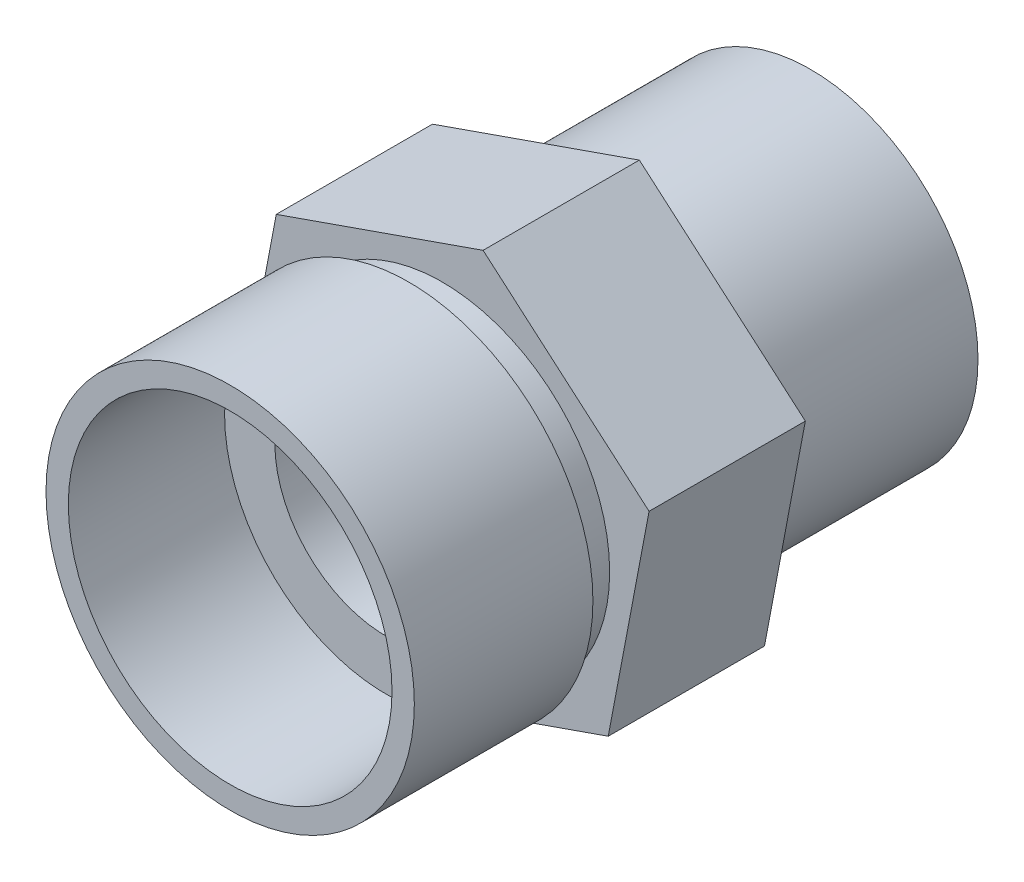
ISO-10303-21;
HEADER;
FILE_DESCRIPTION(('STEP AP214'),'2;1');
FILE_NAME('part.step','',(''),(''),'','','');
FILE_SCHEMA(('AUTOMOTIVE_DESIGN { 1 0 10303 214 1 1 1 1 }'));
ENDSEC;
DATA;
#1=APPLICATION_CONTEXT('core data for automotive mechanical design processes');
#2=APPLICATION_PROTOCOL_DEFINITION('international standard','automotive_design',2000,#1);
#3=PRODUCT_CONTEXT('',#1,'mechanical');
#4=PRODUCT('Part','Part','',(#3));
#5=PRODUCT_RELATED_PRODUCT_CATEGORY('part','',(#4));
#6=PRODUCT_DEFINITION_FORMATION('','',#4);
#7=PRODUCT_DEFINITION_CONTEXT('part definition',#1,'design');
#8=PRODUCT_DEFINITION('design','',#6,#7);
#9=PRODUCT_DEFINITION_SHAPE('','',#8);
#10=(LENGTH_UNIT() NAMED_UNIT(*) SI_UNIT(.MILLI.,.METRE.));
#11=(NAMED_UNIT(*) PLANE_ANGLE_UNIT() SI_UNIT($,.RADIAN.));
#12=(NAMED_UNIT(*) SI_UNIT($,.STERADIAN.) SOLID_ANGLE_UNIT());
#13=UNCERTAINTY_MEASURE_WITH_UNIT(LENGTH_MEASURE(1.E-05),#10,'distance_accuracy_value','');
#14=(GEOMETRIC_REPRESENTATION_CONTEXT(3) GLOBAL_UNCERTAINTY_ASSIGNED_CONTEXT((#13)) GLOBAL_UNIT_ASSIGNED_CONTEXT((#10,
#11,#12)) REPRESENTATION_CONTEXT('',''));
#15=CARTESIAN_POINT('',(0.,0.,0.));
#16=DIRECTION('',(0.,0.,1.));
#17=DIRECTION('',(1.,0.,0.));
#18=AXIS2_PLACEMENT_3D('',#15,#16,#17);
#19=CARTESIAN_POINT('',(7.43637258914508,-6.40575491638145,16.5));
#20=DIRECTION('',(0.,0.,1.));
#21=DIRECTION('',(1.,0.,0.));
#22=AXIS2_PLACEMENT_3D('',#19,#20,#21);
#23=PLANE('',#22);
#24=DIRECTION('',(0.944042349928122,0.329824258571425,0.));
#25=VECTOR('',#24,1.);
#26=CARTESIAN_POINT('',(-1.82936019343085,-9.64296503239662,16.5));
#27=LINE('',#26,#25);
#28=CARTESIAN_POINT('',(-1.82936019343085,-9.64296503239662,16.5));
#29=VERTEX_POINT('',#28);
#30=CARTESIAN_POINT('',(7.43637258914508,-6.40575491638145,16.5));
#31=VERTEX_POINT('',#30);
#32=EDGE_CURVE('E133',#29,#31,#27,.T.);
#33=ORIENTED_EDGE('',*,*,#32,.T.);
#34=DIRECTION('',(0.186384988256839,0.982476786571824,0.));
#35=VECTOR('',#34,1.);
#36=CARTESIAN_POINT('',(7.43637258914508,-6.40575491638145,16.5));
#37=LINE('',#36,#35);
#38=CARTESIAN_POINT('',(9.26573278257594,3.23721011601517,16.5));
#39=VERTEX_POINT('',#38);
#40=EDGE_CURVE('E91',#31,#39,#37,.T.);
#41=ORIENTED_EDGE('',*,*,#40,.T.);
#42=DIRECTION('',(-0.757657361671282,0.652652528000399,0.));
#43=VECTOR('',#42,1.);
#44=CARTESIAN_POINT('',(9.26573278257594,3.23721011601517,16.5));
#45=LINE('',#44,#43);
#46=CARTESIAN_POINT('',(1.82936019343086,9.64296503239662,16.5));
#47=VERTEX_POINT('',#46);
#48=EDGE_CURVE('E104',#39,#47,#45,.T.);
#49=ORIENTED_EDGE('',*,*,#48,.T.);
#50=DIRECTION('',(-0.944042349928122,-0.329824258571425,0.));
#51=VECTOR('',#50,1.);
#52=CARTESIAN_POINT('',(1.82936019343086,9.64296503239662,16.5));
#53=LINE('',#52,#51);
#54=CARTESIAN_POINT('',(-7.43637258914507,6.40575491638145,16.5));
#55=VERTEX_POINT('',#54);
#56=EDGE_CURVE('E98',#47,#55,#53,.T.);
#57=ORIENTED_EDGE('',*,*,#56,.T.);
#58=DIRECTION('',(-0.186384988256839,-0.982476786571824,0.));
#59=VECTOR('',#58,1.);
#60=CARTESIAN_POINT('',(-7.43637258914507,6.40575491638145,16.5));
#61=LINE('',#60,#59);
#62=CARTESIAN_POINT('',(-9.26573278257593,-3.23721011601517,16.5));
#63=VERTEX_POINT('',#62);
#64=EDGE_CURVE('E102',#55,#63,#61,.T.);
#65=ORIENTED_EDGE('',*,*,#64,.T.);
#66=DIRECTION('',(0.757657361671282,-0.652652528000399,0.));
#67=VECTOR('',#66,1.);
#68=CARTESIAN_POINT('',(-9.26573278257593,-3.23721011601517,16.5));
#69=LINE('',#68,#67);
#70=EDGE_CURVE('E53',#63,#29,#69,.T.);
#71=ORIENTED_EDGE('',*,*,#70,.T.);
#72=EDGE_LOOP('',(#33,#41,#49,#57,#65,#71));
#73=FACE_BOUND('',#72,.T.);
#74=CARTESIAN_POINT('',(0.,0.,16.5));
#75=DIRECTION('',(0.,0.,1.));
#76=DIRECTION('',(1.,0.,0.));
#77=AXIS2_PLACEMENT_3D('',#74,#75,#76);
#78=CIRCLE('',#77,7.5);
#79=CARTESIAN_POINT('',(7.5,0.,16.5));
#80=VERTEX_POINT('',#79);
#81=EDGE_CURVE('E195',#80,#80,#78,.T.);
#82=ORIENTED_EDGE('',*,*,#81,.F.);
#83=EDGE_LOOP('',(#82));
#84=FACE_BOUND('',#83,.T.);
#85=ADVANCED_FACE('F36',(#73,#84),#23,.T.);
#86=CARTESIAN_POINT('',(0.,0.,9.5));
#87=DIRECTION('',(0.,0.,-1.));
#88=DIRECTION('',(-1.,0.,0.));
#89=AXIS2_PLACEMENT_3D('',#86,#87,#88);
#90=CYLINDRICAL_SURFACE('',#89,7.5);
#91=CARTESIAN_POINT('',(0.,0.,9.5));
#92=DIRECTION('',(0.,0.,1.));
#93=DIRECTION('',(1.,0.,0.));
#94=AXIS2_PLACEMENT_3D('',#91,#92,#93);
#95=CIRCLE('',#94,7.5);
#96=CARTESIAN_POINT('',(7.5,0.,9.5));
#97=VERTEX_POINT('',#96);
#98=EDGE_CURVE('E45',#97,#97,#95,.T.);
#99=ORIENTED_EDGE('',*,*,#98,.F.);
#100=EDGE_LOOP('',(#99));
#101=FACE_BOUND('',#100,.T.);
#102=CARTESIAN_POINT('',(0.,0.,0.));
#103=DIRECTION('',(0.,0.,1.));
#104=DIRECTION('',(1.,0.,0.));
#105=AXIS2_PLACEMENT_3D('',#102,#103,#104);
#106=CIRCLE('',#105,7.5);
#107=CARTESIAN_POINT('',(7.5,0.,0.));
#108=VERTEX_POINT('',#107);
#109=EDGE_CURVE('E142',#108,#108,#106,.T.);
#110=ORIENTED_EDGE('',*,*,#109,.T.);
#111=EDGE_LOOP('',(#110));
#112=FACE_BOUND('',#111,.T.);
#113=ADVANCED_FACE('F38',(#101,#112),#90,.T.);
#114=CARTESIAN_POINT('',(0.,0.,0.));
#115=DIRECTION('',(0.,0.,1.));
#116=DIRECTION('',(1.,0.,0.));
#117=AXIS2_PLACEMENT_3D('',#114,#115,#116);
#118=PLANE('',#117);
#119=CARTESIAN_POINT('',(0.,0.,0.));
#120=DIRECTION('',(0.,0.,1.));
#121=DIRECTION('',(1.,0.,0.));
#122=AXIS2_PLACEMENT_3D('',#119,#120,#121);
#123=CIRCLE('',#122,5.);
#124=CARTESIAN_POINT('',(5.,0.,0.));
#125=VERTEX_POINT('',#124);
#126=EDGE_CURVE('E203',#125,#125,#123,.T.);
#127=ORIENTED_EDGE('',*,*,#126,.T.);
#128=EDGE_LOOP('',(#127));
#129=FACE_BOUND('',#128,.T.);
#130=ORIENTED_EDGE('',*,*,#109,.F.);
#131=EDGE_LOOP('',(#130));
#132=FACE_BOUND('',#131,.T.);
#133=ADVANCED_FACE('F148',(#129,#132),#118,.F.);
#134=CARTESIAN_POINT('',(7.43637258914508,-6.40575491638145,9.5));
#135=DIRECTION('',(0.,0.,1.));
#136=DIRECTION('',(1.,0.,0.));
#137=AXIS2_PLACEMENT_3D('',#134,#135,#136);
#138=PLANE('',#137);
#139=DIRECTION('',(0.944042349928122,0.329824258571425,0.));
#140=VECTOR('',#139,1.);
#141=CARTESIAN_POINT('',(-1.82936019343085,-9.64296503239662,9.5));
#142=LINE('',#141,#140);
#143=CARTESIAN_POINT('',(-1.82936019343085,-9.64296503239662,9.5));
#144=VERTEX_POINT('',#143);
#145=CARTESIAN_POINT('',(7.43637258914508,-6.40575491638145,9.5));
#146=VERTEX_POINT('',#145);
#147=EDGE_CURVE('E122',#144,#146,#142,.T.);
#148=ORIENTED_EDGE('',*,*,#147,.F.);
#149=DIRECTION('',(0.757657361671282,-0.652652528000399,0.));
#150=VECTOR('',#149,1.);
#151=CARTESIAN_POINT('',(-9.26573278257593,-3.23721011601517,9.5));
#152=LINE('',#151,#150);
#153=CARTESIAN_POINT('',(-9.26573278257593,-3.23721011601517,9.5));
#154=VERTEX_POINT('',#153);
#155=EDGE_CURVE('E82',#154,#144,#152,.T.);
#156=ORIENTED_EDGE('',*,*,#155,.F.);
#157=DIRECTION('',(-0.186384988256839,-0.982476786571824,0.));
#158=VECTOR('',#157,1.);
#159=CARTESIAN_POINT('',(-7.43637258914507,6.40575491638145,9.5));
#160=LINE('',#159,#158);
#161=CARTESIAN_POINT('',(-7.43637258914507,6.40575491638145,9.5));
#162=VERTEX_POINT('',#161);
#163=EDGE_CURVE('E76',#162,#154,#160,.T.);
#164=ORIENTED_EDGE('',*,*,#163,.F.);
#165=DIRECTION('',(-0.944042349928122,-0.329824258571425,0.));
#166=VECTOR('',#165,1.);
#167=CARTESIAN_POINT('',(1.82936019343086,9.64296503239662,9.5));
#168=LINE('',#167,#166);
#169=CARTESIAN_POINT('',(1.82936019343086,9.64296503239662,9.5));
#170=VERTEX_POINT('',#169);
#171=EDGE_CURVE('E112',#170,#162,#168,.T.);
#172=ORIENTED_EDGE('',*,*,#171,.F.);
#173=DIRECTION('',(-0.757657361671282,0.652652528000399,0.));
#174=VECTOR('',#173,1.);
#175=CARTESIAN_POINT('',(9.26573278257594,3.23721011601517,9.5));
#176=LINE('',#175,#174);
#177=CARTESIAN_POINT('',(9.26573278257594,3.23721011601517,9.5));
#178=VERTEX_POINT('',#177);
#179=EDGE_CURVE('E128',#178,#170,#176,.T.);
#180=ORIENTED_EDGE('',*,*,#179,.F.);
#181=DIRECTION('',(0.186384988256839,0.982476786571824,0.));
#182=VECTOR('',#181,1.);
#183=CARTESIAN_POINT('',(7.43637258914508,-6.40575491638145,9.5));
#184=LINE('',#183,#182);
#185=EDGE_CURVE('E125',#146,#178,#184,.T.);
#186=ORIENTED_EDGE('',*,*,#185,.F.);
#187=EDGE_LOOP('',(#148,#156,#164,#172,#180,#186));
#188=FACE_BOUND('',#187,.T.);
#189=ORIENTED_EDGE('',*,*,#98,.T.);
#190=EDGE_LOOP('',(#189));
#191=FACE_BOUND('',#190,.T.);
#192=ADVANCED_FACE('F150',(#188,#191),#138,.F.);
#193=CARTESIAN_POINT('',(-1.82936019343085,-9.64296503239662,16.5));
#194=DIRECTION('',(-0.329824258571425,0.944042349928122,0.));
#195=DIRECTION('',(-0.944042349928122,-0.329824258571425,0.));
#196=AXIS2_PLACEMENT_3D('',#193,#194,#195);
#197=PLANE('',#196);
#198=ORIENTED_EDGE('',*,*,#147,.T.);
#199=DIRECTION('',(0.,0.,-1.));
#200=VECTOR('',#199,1.);
#201=CARTESIAN_POINT('',(7.43637258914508,-6.40575491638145,16.5));
#202=LINE('',#201,#200);
#203=EDGE_CURVE('E140',#31,#146,#202,.T.);
#204=ORIENTED_EDGE('',*,*,#203,.F.);
#205=ORIENTED_EDGE('',*,*,#32,.F.);
#206=DIRECTION('',(0.,0.,-1.));
#207=VECTOR('',#206,1.);
#208=CARTESIAN_POINT('',(-1.82936019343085,-9.64296503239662,16.5));
#209=LINE('',#208,#207);
#210=EDGE_CURVE('E118',#29,#144,#209,.T.);
#211=ORIENTED_EDGE('',*,*,#210,.T.);
#212=EDGE_LOOP('',(#198,#204,#205,#211));
#213=FACE_BOUND('',#212,.T.);
#214=ADVANCED_FACE('F156',(#213),#197,.F.);
#215=CARTESIAN_POINT('',(7.43637258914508,-6.40575491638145,16.5));
#216=DIRECTION('',(-0.982476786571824,0.186384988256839,0.));
#217=DIRECTION('',(-0.186384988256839,-0.982476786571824,0.));
#218=AXIS2_PLACEMENT_3D('',#215,#216,#217);
#219=PLANE('',#218);
#220=ORIENTED_EDGE('',*,*,#185,.T.);
#221=DIRECTION('',(0.,0.,-1.));
#222=VECTOR('',#221,1.);
#223=CARTESIAN_POINT('',(9.26573278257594,3.23721011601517,16.5));
#224=LINE('',#223,#222);
#225=EDGE_CURVE('E137',#39,#178,#224,.T.);
#226=ORIENTED_EDGE('',*,*,#225,.F.);
#227=ORIENTED_EDGE('',*,*,#40,.F.);
#228=ORIENTED_EDGE('',*,*,#203,.T.);
#229=EDGE_LOOP('',(#220,#226,#227,#228));
#230=FACE_BOUND('',#229,.T.);
#231=ADVANCED_FACE('F180',(#230),#219,.F.);
#232=CARTESIAN_POINT('',(9.26573278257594,3.23721011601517,16.5));
#233=DIRECTION('',(-0.652652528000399,-0.757657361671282,0.));
#234=DIRECTION('',(0.757657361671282,-0.652652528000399,0.));
#235=AXIS2_PLACEMENT_3D('',#232,#233,#234);
#236=PLANE('',#235);
#237=ORIENTED_EDGE('',*,*,#179,.T.);
#238=DIRECTION('',(0.,0.,-1.));
#239=VECTOR('',#238,1.);
#240=CARTESIAN_POINT('',(1.82936019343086,9.64296503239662,16.5));
#241=LINE('',#240,#239);
#242=EDGE_CURVE('E113',#47,#170,#241,.T.);
#243=ORIENTED_EDGE('',*,*,#242,.F.);
#244=ORIENTED_EDGE('',*,*,#48,.F.);
#245=ORIENTED_EDGE('',*,*,#225,.T.);
#246=EDGE_LOOP('',(#237,#243,#244,#245));
#247=FACE_BOUND('',#246,.T.);
#248=ADVANCED_FACE('F177',(#247),#236,.F.);
#249=CARTESIAN_POINT('',(1.82936019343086,9.64296503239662,16.5));
#250=DIRECTION('',(0.329824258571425,-0.944042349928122,0.));
#251=DIRECTION('',(0.944042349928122,0.329824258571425,0.));
#252=AXIS2_PLACEMENT_3D('',#249,#250,#251);
#253=PLANE('',#252);
#254=ORIENTED_EDGE('',*,*,#171,.T.);
#255=DIRECTION('',(0.,0.,-1.));
#256=VECTOR('',#255,1.);
#257=CARTESIAN_POINT('',(-7.43637258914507,6.40575491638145,16.5));
#258=LINE('',#257,#256);
#259=EDGE_CURVE('E109',#55,#162,#258,.T.);
#260=ORIENTED_EDGE('',*,*,#259,.F.);
#261=ORIENTED_EDGE('',*,*,#56,.F.);
#262=ORIENTED_EDGE('',*,*,#242,.T.);
#263=EDGE_LOOP('',(#254,#260,#261,#262));
#264=FACE_BOUND('',#263,.T.);
#265=ADVANCED_FACE('F110',(#264),#253,.F.);
#266=CARTESIAN_POINT('',(-7.43637258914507,6.40575491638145,16.5));
#267=DIRECTION('',(0.982476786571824,-0.186384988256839,0.));
#268=DIRECTION('',(0.186384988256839,0.982476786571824,0.));
#269=AXIS2_PLACEMENT_3D('',#266,#267,#268);
#270=PLANE('',#269);
#271=ORIENTED_EDGE('',*,*,#163,.T.);
#272=DIRECTION('',(0.,0.,-1.));
#273=VECTOR('',#272,1.);
#274=CARTESIAN_POINT('',(-9.26573278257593,-3.23721011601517,16.5));
#275=LINE('',#274,#273);
#276=EDGE_CURVE('E114',#63,#154,#275,.T.);
#277=ORIENTED_EDGE('',*,*,#276,.F.);
#278=ORIENTED_EDGE('',*,*,#64,.F.);
#279=ORIENTED_EDGE('',*,*,#259,.T.);
#280=EDGE_LOOP('',(#271,#277,#278,#279));
#281=FACE_BOUND('',#280,.T.);
#282=ADVANCED_FACE('F116',(#281),#270,.F.);
#283=CARTESIAN_POINT('',(-9.26573278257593,-3.23721011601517,16.5));
#284=DIRECTION('',(0.652652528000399,0.757657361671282,0.));
#285=DIRECTION('',(-0.757657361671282,0.652652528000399,0.));
#286=AXIS2_PLACEMENT_3D('',#283,#284,#285);
#287=PLANE('',#286);
#288=ORIENTED_EDGE('',*,*,#155,.T.);
#289=ORIENTED_EDGE('',*,*,#210,.F.);
#290=ORIENTED_EDGE('',*,*,#70,.F.);
#291=ORIENTED_EDGE('',*,*,#276,.T.);
#292=EDGE_LOOP('',(#288,#289,#290,#291));
#293=FACE_BOUND('',#292,.T.);
#294=ADVANCED_FACE('F170',(#293),#287,.F.);
#295=CARTESIAN_POINT('',(0.,0.,18.));
#296=DIRECTION('',(0.,0.,-1.));
#297=DIRECTION('',(-1.,0.,0.));
#298=AXIS2_PLACEMENT_3D('',#295,#296,#297);
#299=CYLINDRICAL_SURFACE('',#298,7.5);
#300=CARTESIAN_POINT('',(0.,0.,18.));
#301=DIRECTION('',(0.,0.,1.));
#302=DIRECTION('',(1.,0.,0.));
#303=AXIS2_PLACEMENT_3D('',#300,#301,#302);
#304=CIRCLE('',#303,7.5);
#305=CARTESIAN_POINT('',(7.5,0.,18.));
#306=VERTEX_POINT('',#305);
#307=EDGE_CURVE('E126',#306,#306,#304,.T.);
#308=ORIENTED_EDGE('',*,*,#307,.F.);
#309=EDGE_LOOP('',(#308));
#310=FACE_BOUND('',#309,.T.);
#311=ORIENTED_EDGE('',*,*,#81,.T.);
#312=EDGE_LOOP('',(#311));
#313=FACE_BOUND('',#312,.T.);
#314=ADVANCED_FACE('F167',(#310,#313),#299,.T.);
#315=CARTESIAN_POINT('',(0.,0.,18.));
#316=DIRECTION('',(0.,0.,1.));
#317=DIRECTION('',(1.,0.,0.));
#318=AXIS2_PLACEMENT_3D('',#315,#316,#317);
#319=PLANE('',#318);
#320=CARTESIAN_POINT('',(0.,0.,18.));
#321=DIRECTION('',(0.,0.,1.));
#322=DIRECTION('',(1.,0.,0.));
#323=AXIS2_PLACEMENT_3D('',#320,#321,#322);
#324=CIRCLE('',#323,8.25);
#325=CARTESIAN_POINT('',(8.25,0.,18.));
#326=VERTEX_POINT('',#325);
#327=EDGE_CURVE('E198',#326,#326,#324,.T.);
#328=ORIENTED_EDGE('',*,*,#327,.F.);
#329=EDGE_LOOP('',(#328));
#330=FACE_BOUND('',#329,.T.);
#331=ORIENTED_EDGE('',*,*,#307,.T.);
#332=EDGE_LOOP('',(#331));
#333=FACE_BOUND('',#332,.T.);
#334=ADVANCED_FACE('F236',(#330,#333),#319,.F.);
#335=CARTESIAN_POINT('',(0.,0.,19.));
#336=DIRECTION('',(0.,0.,-1.));
#337=DIRECTION('',(-1.,0.,0.));
#338=AXIS2_PLACEMENT_3D('',#335,#336,#337);
#339=CYLINDRICAL_SURFACE('',#338,8.25);
#340=ORIENTED_EDGE('',*,*,#327,.T.);
#341=EDGE_LOOP('',(#340));
#342=FACE_BOUND('',#341,.T.);
#343=CARTESIAN_POINT('',(0.,0.,26.));
#344=DIRECTION('',(0.,0.,1.));
#345=DIRECTION('',(1.,0.,0.));
#346=AXIS2_PLACEMENT_3D('',#343,#344,#345);
#347=CIRCLE('',#346,8.25);
#348=CARTESIAN_POINT('',(8.25,0.,26.));
#349=VERTEX_POINT('',#348);
#350=EDGE_CURVE('E207',#349,#349,#347,.T.);
#351=ORIENTED_EDGE('',*,*,#350,.F.);
#352=EDGE_LOOP('',(#351));
#353=FACE_BOUND('',#352,.T.);
#354=ADVANCED_FACE('F234',(#342,#353),#339,.T.);
#355=CARTESIAN_POINT('',(0.,0.,19.));
#356=DIRECTION('',(0.,0.,1.));
#357=DIRECTION('',(1.,0.,0.));
#358=AXIS2_PLACEMENT_3D('',#355,#356,#357);
#359=PLANE('',#358);
#360=CARTESIAN_POINT('',(0.,0.,19.));
#361=DIRECTION('',(0.,0.,1.));
#362=DIRECTION('',(1.,0.,0.));
#363=AXIS2_PLACEMENT_3D('',#360,#361,#362);
#364=CIRCLE('',#363,7.25);
#365=CARTESIAN_POINT('',(7.25,0.,19.));
#366=VERTEX_POINT('',#365);
#367=EDGE_CURVE('E11',#366,#366,#364,.F.);
#368=ORIENTED_EDGE('',*,*,#367,.F.);
#369=EDGE_LOOP('',(#368));
#370=FACE_BOUND('',#369,.T.);
#371=CARTESIAN_POINT('',(0.,0.,19.));
#372=DIRECTION('',(0.,0.,1.));
#373=DIRECTION('',(1.,0.,0.));
#374=AXIS2_PLACEMENT_3D('',#371,#372,#373);
#375=CIRCLE('',#374,5.);
#376=CARTESIAN_POINT('',(5.,0.,19.));
#377=VERTEX_POINT('',#376);
#378=EDGE_CURVE('E204',#377,#377,#375,.T.);
#379=ORIENTED_EDGE('',*,*,#378,.F.);
#380=EDGE_LOOP('',(#379));
#381=FACE_BOUND('',#380,.T.);
#382=ADVANCED_FACE('F228',(#370,#381),#359,.T.);
#383=CARTESIAN_POINT('',(0.,0.,0.));
#384=DIRECTION('',(0.,0.,1.));
#385=DIRECTION('',(1.,0.,0.));
#386=AXIS2_PLACEMENT_3D('',#383,#384,#385);
#387=CYLINDRICAL_SURFACE('',#386,5.);
#388=ORIENTED_EDGE('',*,*,#126,.F.);
#389=EDGE_LOOP('',(#388));
#390=FACE_BOUND('',#389,.T.);
#391=ORIENTED_EDGE('',*,*,#378,.T.);
#392=EDGE_LOOP('',(#391));
#393=FACE_BOUND('',#392,.T.);
#394=ADVANCED_FACE('F220',(#390,#393),#387,.F.);
#395=CARTESIAN_POINT('',(0.,0.,26.));
#396=DIRECTION('',(0.,0.,1.));
#397=DIRECTION('',(1.,0.,0.));
#398=AXIS2_PLACEMENT_3D('',#395,#396,#397);
#399=PLANE('',#398);
#400=ORIENTED_EDGE('',*,*,#350,.T.);
#401=EDGE_LOOP('',(#400));
#402=FACE_BOUND('',#401,.T.);
#403=CARTESIAN_POINT('',(0.,0.,26.));
#404=DIRECTION('',(0.,0.,1.));
#405=DIRECTION('',(1.,0.,0.));
#406=AXIS2_PLACEMENT_3D('',#403,#404,#405);
#407=CIRCLE('',#406,7.25);
#408=CARTESIAN_POINT('',(7.25,0.,26.));
#409=VERTEX_POINT('',#408);
#410=EDGE_CURVE('E211',#409,#409,#407,.T.);
#411=ORIENTED_EDGE('',*,*,#410,.F.);
#412=EDGE_LOOP('',(#411));
#413=FACE_BOUND('',#412,.T.);
#414=ADVANCED_FACE('F218',(#402,#413),#399,.T.);
#415=CARTESIAN_POINT('',(0.,0.,26.));
#416=DIRECTION('',(0.,0.,-1.));
#417=DIRECTION('',(-1.,0.,0.));
#418=AXIS2_PLACEMENT_3D('',#415,#416,#417);
#419=CYLINDRICAL_SURFACE('',#418,7.25);
#420=ORIENTED_EDGE('',*,*,#410,.T.);
#421=EDGE_LOOP('',(#420));
#422=FACE_BOUND('',#421,.T.);
#423=ORIENTED_EDGE('',*,*,#367,.T.);
#424=EDGE_LOOP('',(#423));
#425=FACE_BOUND('',#424,.T.);
#426=ADVANCED_FACE('F215',(#422,#425),#419,.F.);
#427=CLOSED_SHELL('',(#85,#113,#133,#192,#214,#231,#248,#265,#282,#294,#314,#334,#354,#382,#394,
#414,#426));
#428=MANIFOLD_SOLID_BREP('B2',#427);
#429=ADVANCED_BREP_SHAPE_REPRESENTATION('',(#18,#428),#14);
#430=SHAPE_DEFINITION_REPRESENTATION(#9,#429);
ENDSEC;
END-ISO-10303-21;
